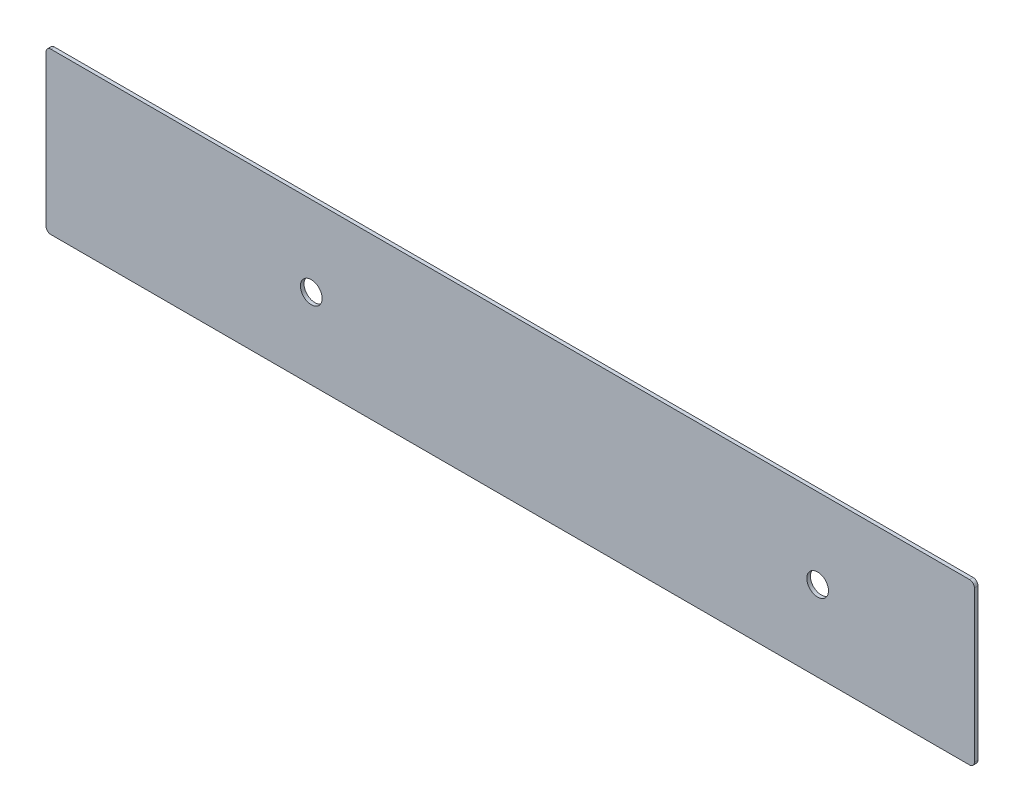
from build123d import *

# Parameters (mm, degrees)
SKETCH2_W           = 385
SKETCH2_H           = 66.6
SKETCH2_R           = 4.5
BOSS_EXTRUDE1_DEPTH = 1.5
FILLET2_R           = 2


with BuildPart() as part:
    # Sketch2 → Boss-Extrude1 (new body)
    with BuildSketch(Plane.XY):
        with Locations((192.5, 33.3)):
            Rectangle(SKETCH2_W, SKETCH2_H)
        with Locations((110, 33.3)):
            Circle(SKETCH2_R, mode=Mode.SUBTRACT)
        with Locations((320, 33.3)):
            Circle(SKETCH2_R, mode=Mode.SUBTRACT)
    extrude(amount=BOSS_EXTRUDE1_DEPTH)

    # Fillet2
    fillet2_edges = [part.edges().sort_by_distance(p)[0] for p in [
        (0, 66.6, 0.75),
        (385, 66.6, 0.75),
        (385, 0, 0.75),
        (0, 0, 0.75),
    ]]
    fillet(fillet2_edges, radius=FILLET2_R)


solid = part.part
